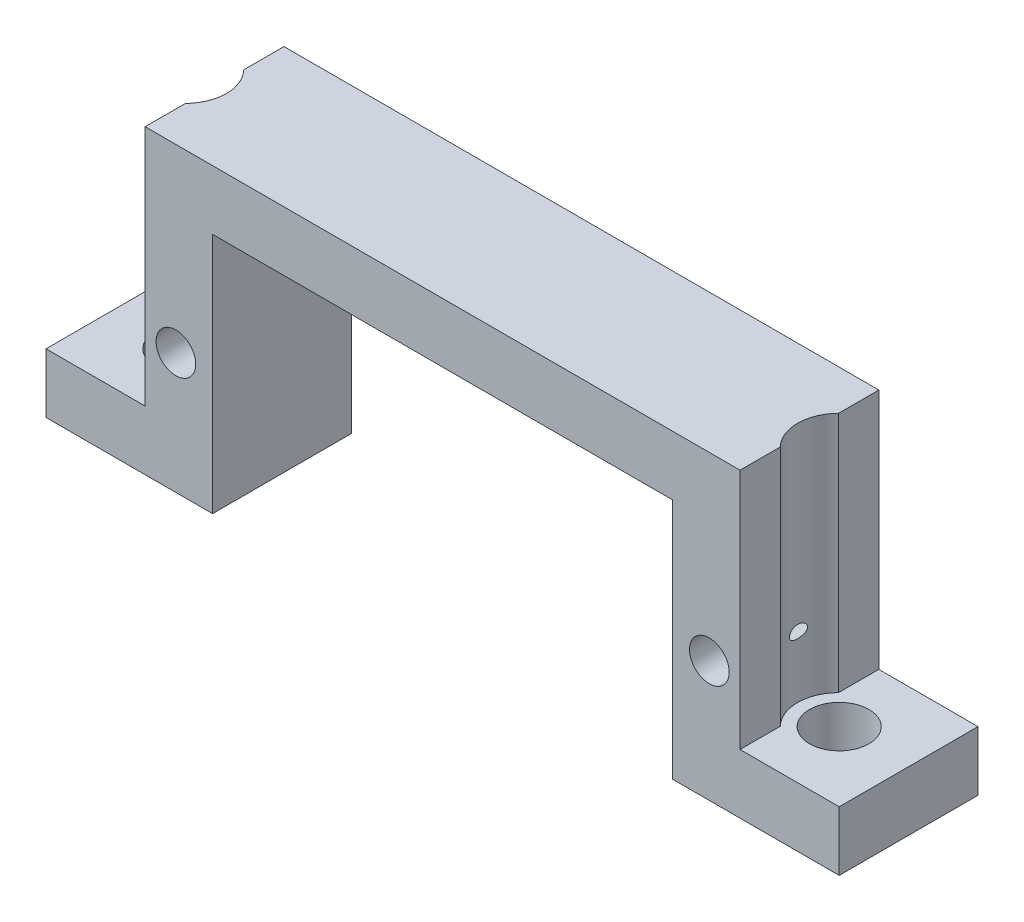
ISO-10303-21;
HEADER;
FILE_DESCRIPTION(('STEP AP214'),'2;1');
FILE_NAME('part.step','',(''),(''),'','','');
FILE_SCHEMA(('AUTOMOTIVE_DESIGN { 1 0 10303 214 1 1 1 1 }'));
ENDSEC;
DATA;
#1=APPLICATION_CONTEXT('core data for automotive mechanical design processes');
#2=APPLICATION_PROTOCOL_DEFINITION('international standard','automotive_design',2000,#1);
#3=PRODUCT_CONTEXT('',#1,'mechanical');
#4=PRODUCT('Part','Part','',(#3));
#5=PRODUCT_RELATED_PRODUCT_CATEGORY('part','',(#4));
#6=PRODUCT_DEFINITION_FORMATION('','',#4);
#7=PRODUCT_DEFINITION_CONTEXT('part definition',#1,'design');
#8=PRODUCT_DEFINITION('design','',#6,#7);
#9=PRODUCT_DEFINITION_SHAPE('','',#8);
#10=(LENGTH_UNIT() NAMED_UNIT(*) SI_UNIT(.MILLI.,.METRE.));
#11=(NAMED_UNIT(*) PLANE_ANGLE_UNIT() SI_UNIT($,.RADIAN.));
#12=(NAMED_UNIT(*) SI_UNIT($,.STERADIAN.) SOLID_ANGLE_UNIT());
#13=UNCERTAINTY_MEASURE_WITH_UNIT(LENGTH_MEASURE(1.E-05),#10,'distance_accuracy_value','');
#14=(GEOMETRIC_REPRESENTATION_CONTEXT(3) GLOBAL_UNCERTAINTY_ASSIGNED_CONTEXT((#13)) GLOBAL_UNIT_ASSIGNED_CONTEXT((#10,
#11,#12)) REPRESENTATION_CONTEXT('',''));
#15=CARTESIAN_POINT('',(0.,0.,0.));
#16=DIRECTION('',(0.,0.,1.));
#17=DIRECTION('',(1.,0.,0.));
#18=AXIS2_PLACEMENT_3D('',#15,#16,#17);
#19=CARTESIAN_POINT('',(-15.,3.,7.));
#20=DIRECTION('',(1.,0.,0.));
#21=DIRECTION('',(0.,0.,-1.));
#22=AXIS2_PLACEMENT_3D('',#19,#20,#21);
#23=PLANE('',#22);
#24=DIRECTION('',(0.,0.,-1.));
#25=VECTOR('',#24,1.);
#26=CARTESIAN_POINT('',(-15.,3.,7.));
#27=LINE('',#26,#25);
#28=CARTESIAN_POINT('',(-15.,3.,2.03030615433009));
#29=VERTEX_POINT('',#28);
#30=CARTESIAN_POINT('',(-15.,3.,0.));
#31=VERTEX_POINT('',#30);
#32=EDGE_CURVE('E177',#29,#31,#27,.T.);
#33=ORIENTED_EDGE('',*,*,#32,.F.);
#34=DIRECTION('',(0.,1.,0.));
#35=VECTOR('',#34,1.);
#36=CARTESIAN_POINT('',(-15.,3.,2.03030615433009));
#37=LINE('',#36,#35);
#38=CARTESIAN_POINT('',(-15.,15.2,2.03030615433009));
#39=VERTEX_POINT('',#38);
#40=EDGE_CURVE('E159',#29,#39,#37,.T.);
#41=ORIENTED_EDGE('',*,*,#40,.T.);
#42=DIRECTION('',(0.,0.,-1.));
#43=VECTOR('',#42,1.);
#44=CARTESIAN_POINT('',(-15.,15.2,7.));
#45=LINE('',#44,#43);
#46=CARTESIAN_POINT('',(-15.,15.2,0.));
#47=VERTEX_POINT('',#46);
#48=EDGE_CURVE('E176',#39,#47,#45,.T.);
#49=ORIENTED_EDGE('',*,*,#48,.T.);
#50=DIRECTION('',(0.,-1.,0.));
#51=VECTOR('',#50,1.);
#52=CARTESIAN_POINT('',(-15.,3.,0.));
#53=LINE('',#52,#51);
#54=EDGE_CURVE('E305',#47,#31,#53,.T.);
#55=ORIENTED_EDGE('',*,*,#54,.T.);
#56=EDGE_LOOP('',(#33,#41,#49,#55));
#57=FACE_BOUND('',#56,.T.);
#58=ADVANCED_FACE('F37',(#57),#23,.F.);
#59=CARTESIAN_POINT('',(15.,3.,7.));
#60=DIRECTION('',(-1.,0.,0.));
#61=DIRECTION('',(0.,0.,1.));
#62=AXIS2_PLACEMENT_3D('',#59,#60,#61);
#63=PLANE('',#62);
#64=DIRECTION('',(0.,0.,-1.));
#65=VECTOR('',#64,1.);
#66=CARTESIAN_POINT('',(15.,3.,7.));
#67=LINE('',#66,#65);
#68=CARTESIAN_POINT('',(15.,3.,7.));
#69=VERTEX_POINT('',#68);
#70=CARTESIAN_POINT('',(15.,3.,4.96969384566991));
#71=VERTEX_POINT('',#70);
#72=EDGE_CURVE('E189',#69,#71,#67,.T.);
#73=ORIENTED_EDGE('',*,*,#72,.T.);
#74=DIRECTION('',(0.,1.,0.));
#75=VECTOR('',#74,1.);
#76=CARTESIAN_POINT('',(15.,3.,4.96969384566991));
#77=LINE('',#76,#75);
#78=CARTESIAN_POINT('',(15.,15.2,4.96969384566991));
#79=VERTEX_POINT('',#78);
#80=EDGE_CURVE('E395',#71,#79,#77,.T.);
#81=ORIENTED_EDGE('',*,*,#80,.T.);
#82=DIRECTION('',(0.,0.,-1.));
#83=VECTOR('',#82,1.);
#84=CARTESIAN_POINT('',(15.,15.2,7.));
#85=LINE('',#84,#83);
#86=CARTESIAN_POINT('',(15.,15.2,7.));
#87=VERTEX_POINT('',#86);
#88=EDGE_CURVE('E185',#87,#79,#85,.T.);
#89=ORIENTED_EDGE('',*,*,#88,.F.);
#90=DIRECTION('',(0.,1.,0.));
#91=VECTOR('',#90,1.);
#92=CARTESIAN_POINT('',(15.,3.,7.));
#93=LINE('',#92,#91);
#94=EDGE_CURVE('E377',#69,#87,#93,.T.);
#95=ORIENTED_EDGE('',*,*,#94,.F.);
#96=EDGE_LOOP('',(#73,#81,#89,#95));
#97=FACE_BOUND('',#96,.T.);
#98=ADVANCED_FACE('F231',(#97),#63,.F.);
#99=CARTESIAN_POINT('',(0.,0.,7.));
#100=DIRECTION('',(0.,0.,1.));
#101=DIRECTION('',(1.,0.,0.));
#102=AXIS2_PLACEMENT_3D('',#99,#100,#101);
#103=PLANE('',#102);
#104=CARTESIAN_POINT('',(13.45,6.1,7.));
#105=DIRECTION('',(0.,0.,1.));
#106=DIRECTION('',(1.,0.,0.));
#107=AXIS2_PLACEMENT_3D('',#104,#105,#106);
#108=CIRCLE('',#107,1.);
#109=CARTESIAN_POINT('',(14.45,6.1,7.));
#110=VERTEX_POINT('',#109);
#111=EDGE_CURVE('E357',#110,#110,#108,.T.);
#112=ORIENTED_EDGE('',*,*,#111,.F.);
#113=EDGE_LOOP('',(#112));
#114=FACE_BOUND('',#113,.T.);
#115=DIRECTION('',(0.,-1.,0.));
#116=VECTOR('',#115,1.);
#117=CARTESIAN_POINT('',(11.6,0.,7.));
#118=LINE('',#117,#116);
#119=CARTESIAN_POINT('',(11.6,12.2,7.));
#120=VERTEX_POINT('',#119);
#121=CARTESIAN_POINT('',(11.6,0.,7.));
#122=VERTEX_POINT('',#121);
#123=EDGE_CURVE('E318',#120,#122,#118,.T.);
#124=ORIENTED_EDGE('',*,*,#123,.T.);
#125=DIRECTION('',(1.,0.,0.));
#126=VECTOR('',#125,1.);
#127=CARTESIAN_POINT('',(11.6,0.,7.));
#128=LINE('',#127,#126);
#129=CARTESIAN_POINT('',(20.,0.,7.));
#130=VERTEX_POINT('',#129);
#131=EDGE_CURVE('E372',#122,#130,#128,.T.);
#132=ORIENTED_EDGE('',*,*,#131,.T.);
#133=DIRECTION('',(0.,1.,0.));
#134=VECTOR('',#133,1.);
#135=CARTESIAN_POINT('',(20.,0.,7.));
#136=LINE('',#135,#134);
#137=CARTESIAN_POINT('',(20.,3.,7.));
#138=VERTEX_POINT('',#137);
#139=EDGE_CURVE('E289',#130,#138,#136,.T.);
#140=ORIENTED_EDGE('',*,*,#139,.T.);
#141=DIRECTION('',(-1.,0.,0.));
#142=VECTOR('',#141,1.);
#143=CARTESIAN_POINT('',(20.,3.,7.));
#144=LINE('',#143,#142);
#145=EDGE_CURVE('E375',#138,#69,#144,.T.);
#146=ORIENTED_EDGE('',*,*,#145,.T.);
#147=ORIENTED_EDGE('',*,*,#94,.T.);
#148=DIRECTION('',(-1.,0.,0.));
#149=VECTOR('',#148,1.);
#150=CARTESIAN_POINT('',(15.,15.2,7.));
#151=LINE('',#150,#149);
#152=CARTESIAN_POINT('',(-15.,15.2,7.));
#153=VERTEX_POINT('',#152);
#154=EDGE_CURVE('E379',#87,#153,#151,.T.);
#155=ORIENTED_EDGE('',*,*,#154,.T.);
#156=DIRECTION('',(0.,-1.,0.));
#157=VECTOR('',#156,1.);
#158=CARTESIAN_POINT('',(-15.,3.,7.));
#159=LINE('',#158,#157);
#160=CARTESIAN_POINT('',(-15.,3.,7.));
#161=VERTEX_POINT('',#160);
#162=EDGE_CURVE('E381',#153,#161,#159,.T.);
#163=ORIENTED_EDGE('',*,*,#162,.T.);
#164=DIRECTION('',(-1.,0.,0.));
#165=VECTOR('',#164,1.);
#166=CARTESIAN_POINT('',(-20.,3.,7.));
#167=LINE('',#166,#165);
#168=CARTESIAN_POINT('',(-20.,3.,7.));
#169=VERTEX_POINT('',#168);
#170=EDGE_CURVE('E175',#161,#169,#167,.T.);
#171=ORIENTED_EDGE('',*,*,#170,.T.);
#172=DIRECTION('',(0.,-1.,0.));
#173=VECTOR('',#172,1.);
#174=CARTESIAN_POINT('',(-20.,0.,7.));
#175=LINE('',#174,#173);
#176=CARTESIAN_POINT('',(-20.,0.,7.));
#177=VERTEX_POINT('',#176);
#178=EDGE_CURVE('E338',#169,#177,#175,.T.);
#179=ORIENTED_EDGE('',*,*,#178,.T.);
#180=DIRECTION('',(1.,0.,0.));
#181=VECTOR('',#180,1.);
#182=CARTESIAN_POINT('',(-11.6,0.,7.));
#183=LINE('',#182,#181);
#184=CARTESIAN_POINT('',(-11.6,0.,7.));
#185=VERTEX_POINT('',#184);
#186=EDGE_CURVE('E352',#177,#185,#183,.T.);
#187=ORIENTED_EDGE('',*,*,#186,.T.);
#188=DIRECTION('',(0.,1.,0.));
#189=VECTOR('',#188,1.);
#190=CARTESIAN_POINT('',(-11.6,0.,7.));
#191=LINE('',#190,#189);
#192=CARTESIAN_POINT('',(-11.6,12.2,7.));
#193=VERTEX_POINT('',#192);
#194=EDGE_CURVE('E349',#185,#193,#191,.T.);
#195=ORIENTED_EDGE('',*,*,#194,.T.);
#196=DIRECTION('',(1.,0.,0.));
#197=VECTOR('',#196,1.);
#198=CARTESIAN_POINT('',(11.6,12.2,7.));
#199=LINE('',#198,#197);
#200=EDGE_CURVE('E323',#193,#120,#199,.T.);
#201=ORIENTED_EDGE('',*,*,#200,.T.);
#202=EDGE_LOOP('',(#124,#132,#140,#146,#147,#155,#163,#171,#179,#187,#195,#201));
#203=FACE_BOUND('',#202,.T.);
#204=CARTESIAN_POINT('',(-13.45,6.1,7.));
#205=DIRECTION('',(0.,0.,1.));
#206=DIRECTION('',(-1.,0.,0.));
#207=AXIS2_PLACEMENT_3D('',#204,#205,#206);
#208=CIRCLE('',#207,1.);
#209=CARTESIAN_POINT('',(-14.45,6.1,7.));
#210=VERTEX_POINT('',#209);
#211=EDGE_CURVE('E364',#210,#210,#208,.T.);
#212=ORIENTED_EDGE('',*,*,#211,.F.);
#213=EDGE_LOOP('',(#212));
#214=FACE_BOUND('',#213,.T.);
#215=ADVANCED_FACE('F237',(#114,#203,#214),#103,.T.);
#216=CARTESIAN_POINT('',(0.,0.,0.));
#217=DIRECTION('',(0.,0.,1.));
#218=DIRECTION('',(1.,0.,0.));
#219=AXIS2_PLACEMENT_3D('',#216,#217,#218);
#220=PLANE('',#219);
#221=DIRECTION('',(0.,-1.,0.));
#222=VECTOR('',#221,1.);
#223=CARTESIAN_POINT('',(11.6,0.,0.));
#224=LINE('',#223,#222);
#225=CARTESIAN_POINT('',(11.6,12.2,0.));
#226=VERTEX_POINT('',#225);
#227=CARTESIAN_POINT('',(11.6,0.,0.));
#228=VERTEX_POINT('',#227);
#229=EDGE_CURVE('E286',#226,#228,#224,.T.);
#230=ORIENTED_EDGE('',*,*,#229,.F.);
#231=DIRECTION('',(1.,0.,0.));
#232=VECTOR('',#231,1.);
#233=CARTESIAN_POINT('',(11.6,12.2,0.));
#234=LINE('',#233,#232);
#235=CARTESIAN_POINT('',(-11.6,12.2,0.));
#236=VERTEX_POINT('',#235);
#237=EDGE_CURVE('E316',#236,#226,#234,.T.);
#238=ORIENTED_EDGE('',*,*,#237,.F.);
#239=DIRECTION('',(0.,1.,0.));
#240=VECTOR('',#239,1.);
#241=CARTESIAN_POINT('',(-11.6,0.,0.));
#242=LINE('',#241,#240);
#243=CARTESIAN_POINT('',(-11.6,0.,0.));
#244=VERTEX_POINT('',#243);
#245=EDGE_CURVE('E314',#244,#236,#242,.T.);
#246=ORIENTED_EDGE('',*,*,#245,.F.);
#247=DIRECTION('',(1.,0.,0.));
#248=VECTOR('',#247,1.);
#249=CARTESIAN_POINT('',(-11.6,0.,0.));
#250=LINE('',#249,#248);
#251=CARTESIAN_POINT('',(-20.,0.,0.));
#252=VERTEX_POINT('',#251);
#253=EDGE_CURVE('E312',#252,#244,#250,.T.);
#254=ORIENTED_EDGE('',*,*,#253,.F.);
#255=DIRECTION('',(0.,-1.,0.));
#256=VECTOR('',#255,1.);
#257=CARTESIAN_POINT('',(-20.,0.,0.));
#258=LINE('',#257,#256);
#259=CARTESIAN_POINT('',(-20.,3.,0.));
#260=VERTEX_POINT('',#259);
#261=EDGE_CURVE('E310',#260,#252,#258,.T.);
#262=ORIENTED_EDGE('',*,*,#261,.F.);
#263=DIRECTION('',(-1.,0.,0.));
#264=VECTOR('',#263,1.);
#265=CARTESIAN_POINT('',(-20.,3.,0.));
#266=LINE('',#265,#264);
#267=EDGE_CURVE('E308',#31,#260,#266,.T.);
#268=ORIENTED_EDGE('',*,*,#267,.F.);
#269=ORIENTED_EDGE('',*,*,#54,.F.);
#270=DIRECTION('',(-1.,0.,0.));
#271=VECTOR('',#270,1.);
#272=CARTESIAN_POINT('',(15.,15.2,0.));
#273=LINE('',#272,#271);
#274=CARTESIAN_POINT('',(15.,15.2,0.));
#275=VERTEX_POINT('',#274);
#276=EDGE_CURVE('E302',#275,#47,#273,.T.);
#277=ORIENTED_EDGE('',*,*,#276,.F.);
#278=DIRECTION('',(0.,1.,0.));
#279=VECTOR('',#278,1.);
#280=CARTESIAN_POINT('',(15.,3.,0.));
#281=LINE('',#280,#279);
#282=CARTESIAN_POINT('',(15.,3.,0.));
#283=VERTEX_POINT('',#282);
#284=EDGE_CURVE('E296',#283,#275,#281,.T.);
#285=ORIENTED_EDGE('',*,*,#284,.F.);
#286=DIRECTION('',(-1.,0.,0.));
#287=VECTOR('',#286,1.);
#288=CARTESIAN_POINT('',(20.,3.,0.));
#289=LINE('',#288,#287);
#290=CARTESIAN_POINT('',(20.,3.,0.));
#291=VERTEX_POINT('',#290);
#292=EDGE_CURVE('E294',#291,#283,#289,.T.);
#293=ORIENTED_EDGE('',*,*,#292,.F.);
#294=DIRECTION('',(0.,1.,0.));
#295=VECTOR('',#294,1.);
#296=CARTESIAN_POINT('',(20.,0.,0.));
#297=LINE('',#296,#295);
#298=CARTESIAN_POINT('',(20.,0.,0.));
#299=VERTEX_POINT('',#298);
#300=EDGE_CURVE('E285',#299,#291,#297,.T.);
#301=ORIENTED_EDGE('',*,*,#300,.F.);
#302=DIRECTION('',(1.,0.,0.));
#303=VECTOR('',#302,1.);
#304=CARTESIAN_POINT('',(11.6,0.,0.));
#305=LINE('',#304,#303);
#306=EDGE_CURVE('E278',#228,#299,#305,.T.);
#307=ORIENTED_EDGE('',*,*,#306,.F.);
#308=EDGE_LOOP('',(#230,#238,#246,#254,#262,#268,#269,#277,#285,#293,#301,#307));
#309=FACE_BOUND('',#308,.T.);
#310=CARTESIAN_POINT('',(13.45,6.1,0.));
#311=DIRECTION('',(0.,0.,1.));
#312=DIRECTION('',(1.,0.,0.));
#313=AXIS2_PLACEMENT_3D('',#310,#311,#312);
#314=CIRCLE('',#313,1.);
#315=CARTESIAN_POINT('',(14.45,6.1,0.));
#316=VERTEX_POINT('',#315);
#317=EDGE_CURVE('E359',#316,#316,#314,.T.);
#318=ORIENTED_EDGE('',*,*,#317,.T.);
#319=EDGE_LOOP('',(#318));
#320=FACE_BOUND('',#319,.T.);
#321=CARTESIAN_POINT('',(-13.45,6.1,0.));
#322=DIRECTION('',(0.,0.,1.));
#323=DIRECTION('',(-1.,0.,0.));
#324=AXIS2_PLACEMENT_3D('',#321,#322,#323);
#325=CIRCLE('',#324,1.);
#326=CARTESIAN_POINT('',(-14.45,6.1,0.));
#327=VERTEX_POINT('',#326);
#328=EDGE_CURVE('E367',#327,#327,#325,.T.);
#329=ORIENTED_EDGE('',*,*,#328,.T.);
#330=EDGE_LOOP('',(#329));
#331=FACE_BOUND('',#330,.T.);
#332=ADVANCED_FACE('F271',(#309,#320,#331),#220,.F.);
#333=CARTESIAN_POINT('',(11.6,0.,7.));
#334=DIRECTION('',(1.,0.,0.));
#335=DIRECTION('',(0.,0.,-1.));
#336=AXIS2_PLACEMENT_3D('',#333,#334,#335);
#337=PLANE('',#336);
#338=ORIENTED_EDGE('',*,*,#229,.T.);
#339=DIRECTION('',(0.,0.,-1.));
#340=VECTOR('',#339,1.);
#341=CARTESIAN_POINT('',(11.6,0.,7.));
#342=LINE('',#341,#340);
#343=EDGE_CURVE('E11',#122,#228,#342,.T.);
#344=ORIENTED_EDGE('',*,*,#343,.F.);
#345=ORIENTED_EDGE('',*,*,#123,.F.);
#346=DIRECTION('',(0.,0.,-1.));
#347=VECTOR('',#346,1.);
#348=CARTESIAN_POINT('',(11.6,12.2,7.));
#349=LINE('',#348,#347);
#350=EDGE_CURVE('E319',#120,#226,#349,.T.);
#351=ORIENTED_EDGE('',*,*,#350,.T.);
#352=EDGE_LOOP('',(#338,#344,#345,#351));
#353=FACE_BOUND('',#352,.T.);
#354=ADVANCED_FACE('F39',(#353),#337,.F.);
#355=CARTESIAN_POINT('',(11.6,0.,7.));
#356=DIRECTION('',(0.,1.,0.));
#357=DIRECTION('',(-1.,0.,0.));
#358=AXIS2_PLACEMENT_3D('',#355,#356,#357);
#359=PLANE('',#358);
#360=CARTESIAN_POINT('',(16.5,0.,3.5));
#361=DIRECTION('',(0.,1.,0.));
#362=DIRECTION('',(-1.,0.,0.));
#363=AXIS2_PLACEMENT_3D('',#360,#361,#362);
#364=CIRCLE('',#363,1.5);
#365=CARTESIAN_POINT('',(15.,0.,3.5));
#366=VERTEX_POINT('',#365);
#367=EDGE_CURVE('E276',#366,#366,#364,.T.);
#368=ORIENTED_EDGE('',*,*,#367,.T.);
#369=EDGE_LOOP('',(#368));
#370=FACE_BOUND('',#369,.T.);
#371=ORIENTED_EDGE('',*,*,#306,.T.);
#372=DIRECTION('',(0.,0.,-1.));
#373=VECTOR('',#372,1.);
#374=CARTESIAN_POINT('',(20.,0.,7.));
#375=LINE('',#374,#373);
#376=EDGE_CURVE('E50',#130,#299,#375,.T.);
#377=ORIENTED_EDGE('',*,*,#376,.F.);
#378=ORIENTED_EDGE('',*,*,#131,.F.);
#379=ORIENTED_EDGE('',*,*,#343,.T.);
#380=EDGE_LOOP('',(#371,#377,#378,#379));
#381=FACE_BOUND('',#380,.T.);
#382=ADVANCED_FACE('F264',(#370,#381),#359,.F.);
#383=CARTESIAN_POINT('',(20.,0.,7.));
#384=DIRECTION('',(-1.,0.,0.));
#385=DIRECTION('',(0.,-1.,0.));
#386=AXIS2_PLACEMENT_3D('',#383,#384,#385);
#387=PLANE('',#386);
#388=ORIENTED_EDGE('',*,*,#300,.T.);
#389=DIRECTION('',(0.,0.,-1.));
#390=VECTOR('',#389,1.);
#391=CARTESIAN_POINT('',(20.,3.,7.));
#392=LINE('',#391,#390);
#393=EDGE_CURVE('E192',#138,#291,#392,.T.);
#394=ORIENTED_EDGE('',*,*,#393,.F.);
#395=ORIENTED_EDGE('',*,*,#139,.F.);
#396=ORIENTED_EDGE('',*,*,#376,.T.);
#397=EDGE_LOOP('',(#388,#394,#395,#396));
#398=FACE_BOUND('',#397,.T.);
#399=ADVANCED_FACE('F261',(#398),#387,.F.);
#400=CARTESIAN_POINT('',(20.,3.,7.));
#401=DIRECTION('',(0.,-1.,0.));
#402=DIRECTION('',(1.,0.,0.));
#403=AXIS2_PLACEMENT_3D('',#400,#401,#402);
#404=PLANE('',#403);
#405=CARTESIAN_POINT('',(15.,3.,2.03030615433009));
#406=VERTEX_POINT('',#405);
#407=EDGE_CURVE('E188',#406,#283,#67,.T.);
#408=ORIENTED_EDGE('',*,*,#407,.F.);
#409=CARTESIAN_POINT('',(16.5,3.,3.5));
#410=DIRECTION('',(0.,1.,0.));
#411=DIRECTION('',(0.,0.,1.));
#412=AXIS2_PLACEMENT_3D('',#409,#410,#411);
#413=CIRCLE('',#412,2.1);
#414=EDGE_CURVE('E202',#406,#71,#413,.T.);
#415=ORIENTED_EDGE('',*,*,#414,.T.);
#416=ORIENTED_EDGE('',*,*,#72,.F.);
#417=ORIENTED_EDGE('',*,*,#145,.F.);
#418=ORIENTED_EDGE('',*,*,#393,.T.);
#419=ORIENTED_EDGE('',*,*,#292,.T.);
#420=EDGE_LOOP('',(#408,#415,#416,#417,#418,#419));
#421=FACE_BOUND('',#420,.T.);
#422=CARTESIAN_POINT('',(16.5,3.,3.5));
#423=DIRECTION('',(0.,1.,0.));
#424=DIRECTION('',(-1.,0.,0.));
#425=AXIS2_PLACEMENT_3D('',#422,#423,#424);
#426=CIRCLE('',#425,1.5);
#427=CARTESIAN_POINT('',(15.,3.,3.5));
#428=VERTEX_POINT('',#427);
#429=EDGE_CURVE('E402',#428,#428,#426,.T.);
#430=ORIENTED_EDGE('',*,*,#429,.F.);
#431=EDGE_LOOP('',(#430));
#432=FACE_BOUND('',#431,.T.);
#433=ADVANCED_FACE('F255',(#421,#432),#404,.F.);
#434=CARTESIAN_POINT('',(15.,15.2,2.03030615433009));
#435=VERTEX_POINT('',#434);
#436=EDGE_CURVE('E184',#435,#275,#85,.T.);
#437=ORIENTED_EDGE('',*,*,#436,.F.);
#438=DIRECTION('',(0.,1.,0.));
#439=VECTOR('',#438,1.);
#440=CARTESIAN_POINT('',(15.,3.,2.03030615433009));
#441=LINE('',#440,#439);
#442=EDGE_CURVE('E66',#435,#406,#441,.F.);
#443=ORIENTED_EDGE('',*,*,#442,.T.);
#444=ORIENTED_EDGE('',*,*,#407,.T.);
#445=ORIENTED_EDGE('',*,*,#284,.T.);
#446=EDGE_LOOP('',(#437,#443,#444,#445));
#447=FACE_BOUND('',#446,.T.);
#448=ADVANCED_FACE('F240',(#447),#63,.F.);
#449=CARTESIAN_POINT('',(15.,15.2,7.));
#450=DIRECTION('',(0.,-1.,0.));
#451=DIRECTION('',(0.,0.,-1.));
#452=AXIS2_PLACEMENT_3D('',#449,#450,#451);
#453=PLANE('',#452);
#454=ORIENTED_EDGE('',*,*,#48,.F.);
#455=CARTESIAN_POINT('',(-16.5,15.2,3.5));
#456=DIRECTION('',(0.,1.,0.));
#457=DIRECTION('',(0.,0.,-1.));
#458=AXIS2_PLACEMENT_3D('',#455,#456,#457);
#459=CIRCLE('',#458,2.1);
#460=CARTESIAN_POINT('',(-15.,15.2,4.96969384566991));
#461=VERTEX_POINT('',#460);
#462=EDGE_CURVE('E161',#461,#39,#459,.T.);
#463=ORIENTED_EDGE('',*,*,#462,.F.);
#464=EDGE_CURVE('E171',#153,#461,#45,.T.);
#465=ORIENTED_EDGE('',*,*,#464,.F.);
#466=ORIENTED_EDGE('',*,*,#154,.F.);
#467=ORIENTED_EDGE('',*,*,#88,.T.);
#468=CARTESIAN_POINT('',(16.5,15.2,3.5));
#469=DIRECTION('',(0.,1.,0.));
#470=DIRECTION('',(0.,0.,1.));
#471=AXIS2_PLACEMENT_3D('',#468,#469,#470);
#472=CIRCLE('',#471,2.1);
#473=EDGE_CURVE('E390',#435,#79,#472,.T.);
#474=ORIENTED_EDGE('',*,*,#473,.F.);
#475=ORIENTED_EDGE('',*,*,#436,.T.);
#476=ORIENTED_EDGE('',*,*,#276,.T.);
#477=EDGE_LOOP('',(#454,#463,#465,#466,#467,#474,#475,#476));
#478=FACE_BOUND('',#477,.T.);
#479=ADVANCED_FACE('F244',(#478),#453,.F.);
#480=ORIENTED_EDGE('',*,*,#464,.T.);
#481=DIRECTION('',(0.,1.,0.));
#482=VECTOR('',#481,1.);
#483=CARTESIAN_POINT('',(-15.,3.,4.96969384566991));
#484=LINE('',#483,#482);
#485=CARTESIAN_POINT('',(-15.,3.,4.96969384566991));
#486=VERTEX_POINT('',#485);
#487=EDGE_CURVE('E156',#461,#486,#484,.F.);
#488=ORIENTED_EDGE('',*,*,#487,.T.);
#489=EDGE_CURVE('E168',#161,#486,#27,.T.);
#490=ORIENTED_EDGE('',*,*,#489,.F.);
#491=ORIENTED_EDGE('',*,*,#162,.F.);
#492=EDGE_LOOP('',(#480,#488,#490,#491));
#493=FACE_BOUND('',#492,.T.);
#494=ADVANCED_FACE('F166',(#493),#23,.F.);
#495=CARTESIAN_POINT('',(-20.,3.,7.));
#496=DIRECTION('',(0.,-1.,0.));
#497=DIRECTION('',(1.,0.,0.));
#498=AXIS2_PLACEMENT_3D('',#495,#496,#497);
#499=PLANE('',#498);
#500=CARTESIAN_POINT('',(-16.5,3.,3.5));
#501=DIRECTION('',(0.,1.,0.));
#502=DIRECTION('',(1.,0.,0.));
#503=AXIS2_PLACEMENT_3D('',#500,#501,#502);
#504=CIRCLE('',#503,1.5);
#505=CARTESIAN_POINT('',(-15.,3.,3.5));
#506=VERTEX_POINT('',#505);
#507=EDGE_CURVE('E398',#506,#506,#504,.T.);
#508=ORIENTED_EDGE('',*,*,#507,.F.);
#509=EDGE_LOOP('',(#508));
#510=FACE_BOUND('',#509,.T.);
#511=ORIENTED_EDGE('',*,*,#489,.T.);
#512=CARTESIAN_POINT('',(-16.5,3.,3.5));
#513=DIRECTION('',(0.,1.,0.));
#514=DIRECTION('',(0.,0.,-1.));
#515=AXIS2_PLACEMENT_3D('',#512,#513,#514);
#516=CIRCLE('',#515,2.1);
#517=EDGE_CURVE('E58',#486,#29,#516,.T.);
#518=ORIENTED_EDGE('',*,*,#517,.T.);
#519=ORIENTED_EDGE('',*,*,#32,.T.);
#520=ORIENTED_EDGE('',*,*,#267,.T.);
#521=DIRECTION('',(0.,0.,-1.));
#522=VECTOR('',#521,1.);
#523=CARTESIAN_POINT('',(-20.,3.,7.));
#524=LINE('',#523,#522);
#525=EDGE_CURVE('E180',#169,#260,#524,.T.);
#526=ORIENTED_EDGE('',*,*,#525,.F.);
#527=ORIENTED_EDGE('',*,*,#170,.F.);
#528=EDGE_LOOP('',(#511,#518,#519,#520,#526,#527));
#529=FACE_BOUND('',#528,.T.);
#530=ADVANCED_FACE('F173',(#510,#529),#499,.F.);
#531=CARTESIAN_POINT('',(-20.,0.,7.));
#532=DIRECTION('',(1.,0.,0.));
#533=DIRECTION('',(0.,1.,0.));
#534=AXIS2_PLACEMENT_3D('',#531,#532,#533);
#535=PLANE('',#534);
#536=ORIENTED_EDGE('',*,*,#261,.T.);
#537=DIRECTION('',(0.,0.,-1.));
#538=VECTOR('',#537,1.);
#539=CARTESIAN_POINT('',(-20.,0.,7.));
#540=LINE('',#539,#538);
#541=EDGE_CURVE('E328',#177,#252,#540,.T.);
#542=ORIENTED_EDGE('',*,*,#541,.F.);
#543=ORIENTED_EDGE('',*,*,#178,.F.);
#544=ORIENTED_EDGE('',*,*,#525,.T.);
#545=EDGE_LOOP('',(#536,#542,#543,#544));
#546=FACE_BOUND('',#545,.T.);
#547=ADVANCED_FACE('F249',(#546),#535,.F.);
#548=CARTESIAN_POINT('',(-11.6,0.,7.));
#549=DIRECTION('',(0.,1.,0.));
#550=DIRECTION('',(-1.,0.,0.));
#551=AXIS2_PLACEMENT_3D('',#548,#549,#550);
#552=PLANE('',#551);
#553=CARTESIAN_POINT('',(-16.5,0.,3.5));
#554=DIRECTION('',(0.,1.,0.));
#555=DIRECTION('',(1.,0.,0.));
#556=AXIS2_PLACEMENT_3D('',#553,#554,#555);
#557=CIRCLE('',#556,1.5);
#558=CARTESIAN_POINT('',(-15.,0.,3.5));
#559=VERTEX_POINT('',#558);
#560=EDGE_CURVE('E399',#559,#559,#557,.T.);
#561=ORIENTED_EDGE('',*,*,#560,.T.);
#562=EDGE_LOOP('',(#561));
#563=FACE_BOUND('',#562,.T.);
#564=ORIENTED_EDGE('',*,*,#253,.T.);
#565=DIRECTION('',(0.,0.,-1.));
#566=VECTOR('',#565,1.);
#567=CARTESIAN_POINT('',(-11.6,0.,7.));
#568=LINE('',#567,#566);
#569=EDGE_CURVE('E326',#185,#244,#568,.T.);
#570=ORIENTED_EDGE('',*,*,#569,.F.);
#571=ORIENTED_EDGE('',*,*,#186,.F.);
#572=ORIENTED_EDGE('',*,*,#541,.T.);
#573=EDGE_LOOP('',(#564,#570,#571,#572));
#574=FACE_BOUND('',#573,.T.);
#575=ADVANCED_FACE('F344',(#563,#574),#552,.F.);
#576=CARTESIAN_POINT('',(-11.6,0.,7.));
#577=DIRECTION('',(-1.,0.,0.));
#578=DIRECTION('',(0.,0.,1.));
#579=AXIS2_PLACEMENT_3D('',#576,#577,#578);
#580=PLANE('',#579);
#581=ORIENTED_EDGE('',*,*,#245,.T.);
#582=DIRECTION('',(0.,0.,-1.));
#583=VECTOR('',#582,1.);
#584=CARTESIAN_POINT('',(-11.6,12.2,7.));
#585=LINE('',#584,#583);
#586=EDGE_CURVE('E322',#193,#236,#585,.T.);
#587=ORIENTED_EDGE('',*,*,#586,.F.);
#588=ORIENTED_EDGE('',*,*,#194,.F.);
#589=ORIENTED_EDGE('',*,*,#569,.T.);
#590=EDGE_LOOP('',(#581,#587,#588,#589));
#591=FACE_BOUND('',#590,.T.);
#592=ADVANCED_FACE('F347',(#591),#580,.F.);
#593=CARTESIAN_POINT('',(11.6,12.2,7.));
#594=DIRECTION('',(0.,1.,0.));
#595=DIRECTION('',(0.,0.,1.));
#596=AXIS2_PLACEMENT_3D('',#593,#594,#595);
#597=PLANE('',#596);
#598=ORIENTED_EDGE('',*,*,#237,.T.);
#599=ORIENTED_EDGE('',*,*,#350,.F.);
#600=ORIENTED_EDGE('',*,*,#200,.F.);
#601=ORIENTED_EDGE('',*,*,#586,.T.);
#602=EDGE_LOOP('',(#598,#599,#600,#601));
#603=FACE_BOUND('',#602,.T.);
#604=ADVANCED_FACE('F226',(#603),#597,.F.);
#605=CARTESIAN_POINT('',(13.45,6.1,7.));
#606=DIRECTION('',(0.,0.,-1.));
#607=DIRECTION('',(-1.,0.,0.));
#608=AXIS2_PLACEMENT_3D('',#605,#606,#607);
#609=CYLINDRICAL_SURFACE('',#608,1.);
#610=CARTESIAN_POINT('',(14.45,6.1,3.95552167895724));
#611=CARTESIAN_POINT('',(14.4499996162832,6.11272550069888,3.95552049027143));
#612=CARTESIAN_POINT('',(14.4497541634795,6.12546657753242,3.95441964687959));
#613=CARTESIAN_POINT('',(14.4487997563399,6.15057441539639,3.95009130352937));
#614=CARTESIAN_POINT('',(14.4480899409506,6.16294043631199,3.94685985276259));
#615=CARTESIAN_POINT('',(14.4462889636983,6.1869021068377,3.93850754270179));
#616=CARTESIAN_POINT('',(14.4451999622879,6.19850168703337,3.93339737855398));
#617=CARTESIAN_POINT('',(14.4427400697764,6.2208027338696,3.92156625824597));
#618=CARTESIAN_POINT('',(14.4413691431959,6.23150408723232,3.91484509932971));
#619=CARTESIAN_POINT('',(14.4377762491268,6.25660373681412,3.89667728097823));
#620=CARTESIAN_POINT('',(14.4354525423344,6.27044345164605,3.88447785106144));
#621=CARTESIAN_POINT('',(14.4306981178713,6.29596012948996,3.85801096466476));
#622=CARTESIAN_POINT('',(14.4282671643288,6.30763199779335,3.84373877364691));
#623=CARTESIAN_POINT('',(14.4225407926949,6.33324094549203,3.80759975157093));
#624=CARTESIAN_POINT('',(14.4192966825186,6.34616354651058,3.78500773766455));
#625=CARTESIAN_POINT('',(14.4133980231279,6.36831791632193,3.73802820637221));
#626=CARTESIAN_POINT('',(14.410744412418,6.3775438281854,3.71363791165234));
#627=CARTESIAN_POINT('',(14.4055018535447,6.39517627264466,3.65551146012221));
#628=CARTESIAN_POINT('',(14.4032257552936,6.40229807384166,3.62135671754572));
#629=CARTESIAN_POINT('',(14.4003649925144,6.41116933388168,3.55227910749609));
#630=CARTESIAN_POINT('',(14.3997825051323,6.41291187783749,3.51735530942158));
#631=CARTESIAN_POINT('',(14.4003667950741,6.41113350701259,3.44722889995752));
#632=CARTESIAN_POINT('',(14.4015549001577,6.40754841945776,3.41202805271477));
#633=CARTESIAN_POINT('',(14.4056083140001,6.39472100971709,3.3427787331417));
#634=CARTESIAN_POINT('',(14.4084705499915,6.38548905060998,3.30872827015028));
#635=CARTESIAN_POINT('',(14.4142970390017,6.36495345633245,3.25440493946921));
#636=CARTESIAN_POINT('',(14.4168900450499,6.35544456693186,3.23341011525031));
#637=CARTESIAN_POINT('',(14.4224460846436,6.33340650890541,3.19311262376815));
#638=CARTESIAN_POINT('',(14.4254085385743,6.32088204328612,3.17380738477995));
#639=CARTESIAN_POINT('',(14.4306377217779,6.29612746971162,3.14233033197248));
#640=CARTESIAN_POINT('',(14.4328911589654,6.28462220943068,3.12958844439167));
#641=CARTESIAN_POINT('',(14.4372436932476,6.25971580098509,3.1060727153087));
#642=CARTESIAN_POINT('',(14.4393430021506,6.24631733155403,3.09529614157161));
#643=CARTESIAN_POINT('',(14.4427610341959,6.22065165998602,3.07830417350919));
#644=CARTESIAN_POINT('',(14.4441515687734,6.20871480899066,3.07160664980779));
#645=CARTESIAN_POINT('',(14.4465543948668,6.18387222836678,3.06023292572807));
#646=CARTESIAN_POINT('',(14.4475669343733,6.17096714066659,3.05555539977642));
#647=CARTESIAN_POINT('',(14.4491023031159,6.1444103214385,3.04852236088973));
#648=CARTESIAN_POINT('',(14.4496218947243,6.13075426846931,3.04618219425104));
#649=CARTESIAN_POINT('',(14.4500892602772,6.1032353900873,3.0440753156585));
#650=CARTESIAN_POINT('',(14.450037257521,6.08937264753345,3.04430759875));
#651=CARTESIAN_POINT('',(14.4494053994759,6.06339378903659,3.04716084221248));
#652=CARTESIAN_POINT('',(14.4488816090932,6.05124725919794,3.04952812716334));
#653=CARTESIAN_POINT('',(14.4474398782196,6.0275070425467,3.05614382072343));
#654=CARTESIAN_POINT('',(14.4465218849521,6.01591342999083,3.06039248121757));
#655=CARTESIAN_POINT('',(14.4443299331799,5.99301248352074,3.07075698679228));
#656=CARTESIAN_POINT('',(14.4430420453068,5.98174040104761,3.0769470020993));
#657=CARTESIAN_POINT('',(14.4402382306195,5.96019110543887,3.09081582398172));
#658=CARTESIAN_POINT('',(14.4387221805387,5.94991443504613,3.09849543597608));
#659=CARTESIAN_POINT('',(14.434692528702,5.9250247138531,3.11963860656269));
#660=CARTESIAN_POINT('',(14.4320901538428,5.91114858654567,3.1339551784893));
#661=CARTESIAN_POINT('',(14.4268921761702,5.88587718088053,3.16463718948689));
#662=CARTESIAN_POINT('',(14.4242966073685,5.874488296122,3.18100774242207));
#663=CARTESIAN_POINT('',(14.418314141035,5.84981916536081,3.22219847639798));
#664=CARTESIAN_POINT('',(14.41504123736,5.8376897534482,3.24772319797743));
#665=CARTESIAN_POINT('',(14.4093368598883,5.81754521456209,3.30041206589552));
#666=CARTESIAN_POINT('',(14.40690649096,5.80953548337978,3.32757831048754));
#667=CARTESIAN_POINT('',(14.4025767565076,5.7955883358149,3.39024607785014));
#668=CARTESIAN_POINT('',(14.4009961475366,5.79078814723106,3.4260238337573));
#669=CARTESIAN_POINT('',(14.3996917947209,5.78680897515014,3.49796134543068));
#670=CARTESIAN_POINT('',(14.3999710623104,5.7876391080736,3.53412162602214));
#671=CARTESIAN_POINT('',(14.4023682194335,5.79502365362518,3.60603739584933));
#672=CARTESIAN_POINT('',(14.404497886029,5.80161473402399,3.64178880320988));
#673=CARTESIAN_POINT('',(14.4103763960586,5.82110157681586,3.71137236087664));
#674=CARTESIAN_POINT('',(14.4141196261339,5.83397550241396,3.74521070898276));
#675=CARTESIAN_POINT('',(14.4207186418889,5.8596021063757,3.7948112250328));
#676=CARTESIAN_POINT('',(14.4232282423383,5.86986010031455,3.81191721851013));
#677=CARTESIAN_POINT('',(14.4283698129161,5.89280132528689,3.84440687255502));
#678=CARTESIAN_POINT('',(14.4310015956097,5.90548092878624,3.85979305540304));
#679=CARTESIAN_POINT('',(14.4355833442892,5.9304409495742,3.88511535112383));
#680=CARTESIAN_POINT('',(14.4375600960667,5.94224215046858,3.89551664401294));
#681=CARTESIAN_POINT('',(14.4412515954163,5.96740583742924,3.91430242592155));
#682=CARTESIAN_POINT('',(14.4429665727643,5.98076693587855,3.92268868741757));
#683=CARTESIAN_POINT('',(14.4456752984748,6.00637246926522,3.93564447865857));
#684=CARTESIAN_POINT('',(14.4467428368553,6.01840026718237,3.94062581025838));
#685=CARTESIAN_POINT('',(14.4484577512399,6.04312728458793,3.94854334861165));
#686=CARTESIAN_POINT('',(14.4491061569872,6.05582477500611,3.95148456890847));
#687=CARTESIAN_POINT('',(14.449671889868,6.07385972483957,3.95404300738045));
#688=CARTESIAN_POINT('',(14.4497945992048,6.07907034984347,3.95459649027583));
#689=CARTESIAN_POINT('',(14.449958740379,6.08951976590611,3.95533610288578));
#690=CARTESIAN_POINT('',(14.450000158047,6.09475856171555,3.95552216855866));
#691=CARTESIAN_POINT('',(14.45,6.1,3.95552167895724));
#692=B_SPLINE_CURVE_WITH_KNOTS('',3,(#610,#611,#612,#613,#614,#615,#616,#617,#618,#619,#620,
#621,#622,#623,#624,#625,#626,#627,#628,#629,#630,#631,#632,#633,#634,#635,#636,#637,#638,#639,
#640,#641,#642,#643,#644,#645,#646,#647,#648,#649,#650,#651,#652,#653,#654,#655,#656,#657,#658,
#659,#660,#661,#662,#663,#664,#665,#666,#667,#668,#669,#670,#671,#672,#673,#674,#675,#676,#677,
#678,#679,#680,#681,#682,#683,#684,#685,#686,#687,#688,#689,#690,#691),.UNSPECIFIED.,.T.,.F.,(4,
2,2,2,2,2,2,2,2,2,2,2,2,2,2,2,2,2,2,2,2,2,2,2,2,2,2,2,2,2,2,2,2,2,2,2,2,2,2,2,4),(0.,
0.0381555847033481,0.0763821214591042,0.114394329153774,0.15241132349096,0.20788374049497,
0.263484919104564,0.34173870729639,0.420115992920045,0.524466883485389,0.628951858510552,
0.734705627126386,0.840265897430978,0.909643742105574,0.97891408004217,1.03068607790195,
1.08238554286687,1.12349622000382,1.16457987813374,1.20593153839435,1.24726704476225,
1.28425717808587,1.32125226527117,1.35988107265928,1.39853082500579,1.45851117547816,
1.51864393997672,1.60352634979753,1.68851965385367,1.79637859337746,1.90441221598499,
2.0131385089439,2.12148957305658,2.18163129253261,2.24168361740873,2.28907781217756,
2.33643016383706,2.37545779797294,2.41438917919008,2.43010213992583,2.44581783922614),.UNSPECIFIED.);
#693=CARTESIAN_POINT('',(14.45,6.1,3.95552167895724));
#694=VERTEX_POINT('',#693);
#695=EDGE_CURVE('E196',#694,#694,#692,.T.);
#696=ORIENTED_EDGE('',*,*,#695,.F.);
#697=EDGE_LOOP('',(#696));
#698=FACE_BOUND('',#697,.T.);
#699=ORIENTED_EDGE('',*,*,#111,.T.);
#700=EDGE_LOOP('',(#699));
#701=FACE_BOUND('',#700,.T.);
#702=ORIENTED_EDGE('',*,*,#317,.F.);
#703=EDGE_LOOP('',(#702));
#704=FACE_BOUND('',#703,.T.);
#705=ADVANCED_FACE('F203',(#698,#701,#704),#609,.F.);
#706=CARTESIAN_POINT('',(-13.45,6.1,7.));
#707=DIRECTION('',(0.,0.,-1.));
#708=DIRECTION('',(-1.,0.,0.));
#709=AXIS2_PLACEMENT_3D('',#706,#707,#708);
#710=CYLINDRICAL_SURFACE('',#709,1.);
#711=CARTESIAN_POINT('',(-14.45,6.1,3.95552167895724));
#712=CARTESIAN_POINT('',(-14.4499996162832,6.08727449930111,3.95552049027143));
#713=CARTESIAN_POINT('',(-14.4497541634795,6.07453342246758,3.95441964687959));
#714=CARTESIAN_POINT('',(-14.4487997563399,6.04942558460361,3.95009130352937));
#715=CARTESIAN_POINT('',(-14.4480899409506,6.03705956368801,3.94685985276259));
#716=CARTESIAN_POINT('',(-14.4462889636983,6.0130978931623,3.93850754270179));
#717=CARTESIAN_POINT('',(-14.4451999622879,6.00149831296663,3.93339737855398));
#718=CARTESIAN_POINT('',(-14.4427400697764,5.9791972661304,3.92156625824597));
#719=CARTESIAN_POINT('',(-14.4413691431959,5.96849591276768,3.91484509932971));
#720=CARTESIAN_POINT('',(-14.4377762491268,5.94339626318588,3.89667728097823));
#721=CARTESIAN_POINT('',(-14.4354525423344,5.92955654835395,3.88447785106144));
#722=CARTESIAN_POINT('',(-14.4306981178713,5.90403987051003,3.85801096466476));
#723=CARTESIAN_POINT('',(-14.4282671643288,5.89236800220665,3.84373877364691));
#724=CARTESIAN_POINT('',(-14.4225407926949,5.86675905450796,3.80759975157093));
#725=CARTESIAN_POINT('',(-14.4192966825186,5.85383645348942,3.78500773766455));
#726=CARTESIAN_POINT('',(-14.4133980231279,5.83168208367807,3.73802820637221));
#727=CARTESIAN_POINT('',(-14.410744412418,5.8224561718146,3.71363791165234));
#728=CARTESIAN_POINT('',(-14.4055018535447,5.80482372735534,3.65551146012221));
#729=CARTESIAN_POINT('',(-14.4032257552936,5.79770192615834,3.62135671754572));
#730=CARTESIAN_POINT('',(-14.4003649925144,5.78883066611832,3.55227910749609));
#731=CARTESIAN_POINT('',(-14.3997825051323,5.78708812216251,3.51735530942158));
#732=CARTESIAN_POINT('',(-14.4003667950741,5.7888664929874,3.44722889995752));
#733=CARTESIAN_POINT('',(-14.4015549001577,5.79245158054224,3.41202805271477));
#734=CARTESIAN_POINT('',(-14.4056083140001,5.80527899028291,3.3427787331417));
#735=CARTESIAN_POINT('',(-14.4084705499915,5.81451094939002,3.30872827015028));
#736=CARTESIAN_POINT('',(-14.4142970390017,5.83504654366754,3.25440493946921));
#737=CARTESIAN_POINT('',(-14.4168900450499,5.84455543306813,3.23341011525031));
#738=CARTESIAN_POINT('',(-14.4224460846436,5.86659349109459,3.19311262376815));
#739=CARTESIAN_POINT('',(-14.4254085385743,5.87911795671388,3.17380738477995));
#740=CARTESIAN_POINT('',(-14.4306377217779,5.90387253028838,3.14233033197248));
#741=CARTESIAN_POINT('',(-14.4328911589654,5.91537779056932,3.12958844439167));
#742=CARTESIAN_POINT('',(-14.4372436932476,5.94028419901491,3.1060727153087));
#743=CARTESIAN_POINT('',(-14.4393430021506,5.95368266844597,3.09529614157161));
#744=CARTESIAN_POINT('',(-14.4427610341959,5.97934834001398,3.07830417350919));
#745=CARTESIAN_POINT('',(-14.4441515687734,5.99128519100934,3.07160664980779));
#746=CARTESIAN_POINT('',(-14.4465543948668,6.01612777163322,3.06023292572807));
#747=CARTESIAN_POINT('',(-14.4475669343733,6.02903285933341,3.05555539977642));
#748=CARTESIAN_POINT('',(-14.4491023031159,6.05558967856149,3.04852236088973));
#749=CARTESIAN_POINT('',(-14.4496218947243,6.06924573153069,3.04618219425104));
#750=CARTESIAN_POINT('',(-14.4500892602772,6.0967646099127,3.0440753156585));
#751=CARTESIAN_POINT('',(-14.450037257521,6.11062735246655,3.04430759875));
#752=CARTESIAN_POINT('',(-14.4494053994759,6.13660621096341,3.04716084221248));
#753=CARTESIAN_POINT('',(-14.4488816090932,6.14875274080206,3.04952812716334));
#754=CARTESIAN_POINT('',(-14.4474398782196,6.1724929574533,3.05614382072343));
#755=CARTESIAN_POINT('',(-14.4465218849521,6.18408657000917,3.06039248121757));
#756=CARTESIAN_POINT('',(-14.4443299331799,6.20698751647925,3.07075698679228));
#757=CARTESIAN_POINT('',(-14.4430420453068,6.21825959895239,3.0769470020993));
#758=CARTESIAN_POINT('',(-14.4402382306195,6.23980889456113,3.09081582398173));
#759=CARTESIAN_POINT('',(-14.4387221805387,6.25008556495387,3.09849543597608));
#760=CARTESIAN_POINT('',(-14.434692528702,6.2749752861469,3.11963860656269));
#761=CARTESIAN_POINT('',(-14.4320901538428,6.28885141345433,3.1339551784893));
#762=CARTESIAN_POINT('',(-14.4268921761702,6.31412281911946,3.16463718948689));
#763=CARTESIAN_POINT('',(-14.4242966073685,6.325511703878,3.18100774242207));
#764=CARTESIAN_POINT('',(-14.418314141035,6.35018083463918,3.22219847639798));
#765=CARTESIAN_POINT('',(-14.41504123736,6.3623102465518,3.24772319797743));
#766=CARTESIAN_POINT('',(-14.4093368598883,6.38245478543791,3.30041206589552));
#767=CARTESIAN_POINT('',(-14.40690649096,6.39046451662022,3.32757831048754));
#768=CARTESIAN_POINT('',(-14.4025767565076,6.4044116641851,3.39024607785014));
#769=CARTESIAN_POINT('',(-14.4009961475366,6.40921185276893,3.4260238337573));
#770=CARTESIAN_POINT('',(-14.3996917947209,6.41319102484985,3.49796134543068));
#771=CARTESIAN_POINT('',(-14.3999710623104,6.4123608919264,3.53412162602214));
#772=CARTESIAN_POINT('',(-14.4023682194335,6.40497634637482,3.60603739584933));
#773=CARTESIAN_POINT('',(-14.404497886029,6.39838526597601,3.64178880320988));
#774=CARTESIAN_POINT('',(-14.4103763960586,6.37889842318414,3.71137236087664));
#775=CARTESIAN_POINT('',(-14.4141196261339,6.36602449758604,3.74521070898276));
#776=CARTESIAN_POINT('',(-14.4207186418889,6.3403978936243,3.7948112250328));
#777=CARTESIAN_POINT('',(-14.4232282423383,6.33013989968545,3.81191721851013));
#778=CARTESIAN_POINT('',(-14.4283698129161,6.30719867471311,3.84440687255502));
#779=CARTESIAN_POINT('',(-14.4310015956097,6.29451907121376,3.85979305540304));
#780=CARTESIAN_POINT('',(-14.4355833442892,6.2695590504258,3.88511535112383));
#781=CARTESIAN_POINT('',(-14.4375600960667,6.25775784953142,3.89551664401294));
#782=CARTESIAN_POINT('',(-14.4412515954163,6.23259416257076,3.91430242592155));
#783=CARTESIAN_POINT('',(-14.4429665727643,6.21923306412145,3.92268868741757));
#784=CARTESIAN_POINT('',(-14.4456752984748,6.19362753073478,3.93564447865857));
#785=CARTESIAN_POINT('',(-14.4467428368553,6.18159973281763,3.94062581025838));
#786=CARTESIAN_POINT('',(-14.4484577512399,6.15687271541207,3.94854334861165));
#787=CARTESIAN_POINT('',(-14.4491061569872,6.14417522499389,3.95148456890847));
#788=CARTESIAN_POINT('',(-14.449671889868,6.12614027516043,3.95404300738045));
#789=CARTESIAN_POINT('',(-14.4497945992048,6.12092965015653,3.95459649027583));
#790=CARTESIAN_POINT('',(-14.449958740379,6.11048023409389,3.95533610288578));
#791=CARTESIAN_POINT('',(-14.450000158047,6.10524143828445,3.95552216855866));
#792=CARTESIAN_POINT('',(-14.45,6.1,3.95552167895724));
#793=B_SPLINE_CURVE_WITH_KNOTS('',3,(#711,#712,#713,#714,#715,#716,#717,#718,#719,#720,#721,
#722,#723,#724,#725,#726,#727,#728,#729,#730,#731,#732,#733,#734,#735,#736,#737,#738,#739,#740,
#741,#742,#743,#744,#745,#746,#747,#748,#749,#750,#751,#752,#753,#754,#755,#756,#757,#758,#759,
#760,#761,#762,#763,#764,#765,#766,#767,#768,#769,#770,#771,#772,#773,#774,#775,#776,#777,#778,
#779,#780,#781,#782,#783,#784,#785,#786,#787,#788,#789,#790,#791,#792),.UNSPECIFIED.,.T.,.F.,(4,
2,2,2,2,2,2,2,2,2,2,2,2,2,2,2,2,2,2,2,2,2,2,2,2,2,2,2,2,2,2,2,2,2,2,2,2,2,2,2,4),(0.,
0.0381555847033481,0.0763821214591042,0.114394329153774,0.15241132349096,0.20788374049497,
0.263484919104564,0.34173870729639,0.420115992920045,0.524466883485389,0.628951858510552,
0.734705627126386,0.840265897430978,0.909643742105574,0.97891408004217,1.03068607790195,
1.08238554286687,1.12349622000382,1.16457987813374,1.20593153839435,1.24726704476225,
1.28425717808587,1.32125226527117,1.35988107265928,1.39853082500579,1.45851117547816,
1.51864393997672,1.60352634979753,1.68851965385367,1.79637859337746,1.90441221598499,
2.0131385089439,2.12148957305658,2.18163129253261,2.24168361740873,2.28907781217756,
2.33643016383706,2.37545779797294,2.41438917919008,2.43010213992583,2.44581783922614),.UNSPECIFIED.);
#794=CARTESIAN_POINT('',(-14.45,6.1,3.95552167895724));
#795=VERTEX_POINT('',#794);
#796=EDGE_CURVE('E41',#795,#795,#793,.T.);
#797=ORIENTED_EDGE('',*,*,#796,.F.);
#798=EDGE_LOOP('',(#797));
#799=FACE_BOUND('',#798,.T.);
#800=ORIENTED_EDGE('',*,*,#211,.T.);
#801=EDGE_LOOP('',(#800));
#802=FACE_BOUND('',#801,.T.);
#803=ORIENTED_EDGE('',*,*,#328,.F.);
#804=EDGE_LOOP('',(#803));
#805=FACE_BOUND('',#804,.T.);
#806=ADVANCED_FACE('F218',(#799,#802,#805),#710,.F.);
#807=CARTESIAN_POINT('',(16.5,0.,3.5));
#808=DIRECTION('',(0.,1.,0.));
#809=DIRECTION('',(-1.,0.,0.));
#810=AXIS2_PLACEMENT_3D('',#807,#808,#809);
#811=CYLINDRICAL_SURFACE('',#810,1.5);
#812=ORIENTED_EDGE('',*,*,#367,.F.);
#813=EDGE_LOOP('',(#812));
#814=FACE_BOUND('',#813,.T.);
#815=ORIENTED_EDGE('',*,*,#429,.T.);
#816=EDGE_LOOP('',(#815));
#817=FACE_BOUND('',#816,.T.);
#818=ADVANCED_FACE('F215',(#814,#817),#811,.F.);
#819=CARTESIAN_POINT('',(-16.5,0.,3.5));
#820=DIRECTION('',(0.,1.,0.));
#821=DIRECTION('',(-1.,0.,0.));
#822=AXIS2_PLACEMENT_3D('',#819,#820,#821);
#823=CYLINDRICAL_SURFACE('',#822,1.5);
#824=ORIENTED_EDGE('',*,*,#560,.F.);
#825=EDGE_LOOP('',(#824));
#826=FACE_BOUND('',#825,.T.);
#827=ORIENTED_EDGE('',*,*,#507,.T.);
#828=EDGE_LOOP('',(#827));
#829=FACE_BOUND('',#828,.T.);
#830=ADVANCED_FACE('F210',(#826,#829),#823,.F.);
#831=CARTESIAN_POINT('',(16.5,3.,3.5));
#832=DIRECTION('',(0.,1.,0.));
#833=DIRECTION('',(0.,0.,1.));
#834=AXIS2_PLACEMENT_3D('',#831,#832,#833);
#835=CYLINDRICAL_SURFACE('',#834,2.1);
#836=ORIENTED_EDGE('',*,*,#695,.T.);
#837=EDGE_LOOP('',(#836));
#838=FACE_BOUND('',#837,.T.);
#839=ORIENTED_EDGE('',*,*,#414,.F.);
#840=ORIENTED_EDGE('',*,*,#442,.F.);
#841=ORIENTED_EDGE('',*,*,#473,.T.);
#842=ORIENTED_EDGE('',*,*,#80,.F.);
#843=EDGE_LOOP('',(#839,#840,#841,#842));
#844=FACE_BOUND('',#843,.T.);
#845=ADVANCED_FACE('F206',(#838,#844),#835,.F.);
#846=CARTESIAN_POINT('',(-16.5,3.,3.5));
#847=DIRECTION('',(0.,1.,0.));
#848=DIRECTION('',(0.,0.,1.));
#849=AXIS2_PLACEMENT_3D('',#846,#847,#848);
#850=CYLINDRICAL_SURFACE('',#849,2.1);
#851=ORIENTED_EDGE('',*,*,#796,.T.);
#852=EDGE_LOOP('',(#851));
#853=FACE_BOUND('',#852,.T.);
#854=ORIENTED_EDGE('',*,*,#517,.F.);
#855=ORIENTED_EDGE('',*,*,#487,.F.);
#856=ORIENTED_EDGE('',*,*,#462,.T.);
#857=ORIENTED_EDGE('',*,*,#40,.F.);
#858=EDGE_LOOP('',(#854,#855,#856,#857));
#859=FACE_BOUND('',#858,.T.);
#860=ADVANCED_FACE('F155',(#853,#859),#850,.F.);
#861=CLOSED_SHELL('',(#58,#98,#215,#332,#354,#382,#399,#433,#448,#479,#494,#530,#547,#575,#592,
#604,#705,#806,#818,#830,#845,#860));
#862=MANIFOLD_SOLID_BREP('B2',#861);
#863=ADVANCED_BREP_SHAPE_REPRESENTATION('',(#18,#862),#14);
#864=SHAPE_DEFINITION_REPRESENTATION(#9,#863);
ENDSEC;
END-ISO-10303-21;
